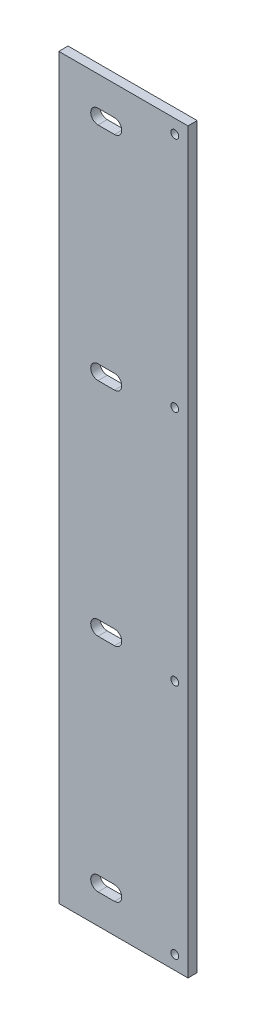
ISO-10303-21;
HEADER;
FILE_DESCRIPTION(('STEP AP214'),'2;1');
FILE_NAME('part.step','',(''),(''),'','','');
FILE_SCHEMA(('AUTOMOTIVE_DESIGN { 1 0 10303 214 1 1 1 1 }'));
ENDSEC;
DATA;
#1=APPLICATION_CONTEXT('core data for automotive mechanical design processes');
#2=APPLICATION_PROTOCOL_DEFINITION('international standard','automotive_design',2000,#1);
#3=PRODUCT_CONTEXT('',#1,'mechanical');
#4=PRODUCT('Part','Part','',(#3));
#5=PRODUCT_RELATED_PRODUCT_CATEGORY('part','',(#4));
#6=PRODUCT_DEFINITION_FORMATION('','',#4);
#7=PRODUCT_DEFINITION_CONTEXT('part definition',#1,'design');
#8=PRODUCT_DEFINITION('design','',#6,#7);
#9=PRODUCT_DEFINITION_SHAPE('','',#8);
#10=(LENGTH_UNIT() NAMED_UNIT(*) SI_UNIT(.MILLI.,.METRE.));
#11=(NAMED_UNIT(*) PLANE_ANGLE_UNIT() SI_UNIT($,.RADIAN.));
#12=(NAMED_UNIT(*) SI_UNIT($,.STERADIAN.) SOLID_ANGLE_UNIT());
#13=UNCERTAINTY_MEASURE_WITH_UNIT(LENGTH_MEASURE(1.E-05),#10,'distance_accuracy_value','');
#14=(GEOMETRIC_REPRESENTATION_CONTEXT(3) GLOBAL_UNCERTAINTY_ASSIGNED_CONTEXT((#13)) GLOBAL_UNIT_ASSIGNED_CONTEXT((#10,
#11,#12)) REPRESENTATION_CONTEXT('',''));
#15=CARTESIAN_POINT('',(0.,0.,0.));
#16=DIRECTION('',(0.,0.,1.));
#17=DIRECTION('',(1.,0.,0.));
#18=AXIS2_PLACEMENT_3D('',#15,#16,#17);
#19=CARTESIAN_POINT('',(-14.9893045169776,183.525395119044,3.175));
#20=DIRECTION('',(1.,0.,0.));
#21=DIRECTION('',(0.,1.,0.));
#22=AXIS2_PLACEMENT_3D('',#19,#20,#21);
#23=PLANE('',#22);
#24=DIRECTION('',(0.,-1.,0.));
#25=VECTOR('',#24,1.);
#26=CARTESIAN_POINT('',(-14.9893045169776,183.525395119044,0.));
#27=LINE('',#26,#25);
#28=CARTESIAN_POINT('',(-14.9893045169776,183.525395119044,0.));
#29=VERTEX_POINT('',#28);
#30=CARTESIAN_POINT('',(-14.9893045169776,-70.4746048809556,0.));
#31=VERTEX_POINT('',#30);
#32=EDGE_CURVE('E324',#29,#31,#27,.T.);
#33=ORIENTED_EDGE('',*,*,#32,.T.);
#34=DIRECTION('',(0.,0.,-1.));
#35=VECTOR('',#34,1.);
#36=CARTESIAN_POINT('',(-14.9893045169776,-70.4746048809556,3.175));
#37=LINE('',#36,#35);
#38=CARTESIAN_POINT('',(-14.9893045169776,-70.4746048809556,3.175));
#39=VERTEX_POINT('',#38);
#40=EDGE_CURVE('E12',#39,#31,#37,.T.);
#41=ORIENTED_EDGE('',*,*,#40,.F.);
#42=DIRECTION('',(0.,-1.,0.));
#43=VECTOR('',#42,1.);
#44=CARTESIAN_POINT('',(-14.9893045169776,183.525395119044,3.175));
#45=LINE('',#44,#43);
#46=CARTESIAN_POINT('',(-14.9893045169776,183.525395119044,3.175));
#47=VERTEX_POINT('',#46);
#48=EDGE_CURVE('E325',#47,#39,#45,.T.);
#49=ORIENTED_EDGE('',*,*,#48,.F.);
#50=DIRECTION('',(0.,0.,-1.));
#51=VECTOR('',#50,1.);
#52=CARTESIAN_POINT('',(-14.9893045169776,183.525395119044,3.175));
#53=LINE('',#52,#51);
#54=EDGE_CURVE('E335',#47,#29,#53,.T.);
#55=ORIENTED_EDGE('',*,*,#54,.T.);
#56=EDGE_LOOP('',(#33,#41,#49,#55));
#57=FACE_BOUND('',#56,.T.);
#58=ADVANCED_FACE('F32',(#57),#23,.F.);
#59=CARTESIAN_POINT('',(-14.9893045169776,-70.4746048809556,3.175));
#60=DIRECTION('',(0.,1.,0.));
#61=DIRECTION('',(-1.,0.,0.));
#62=AXIS2_PLACEMENT_3D('',#59,#60,#61);
#63=PLANE('',#62);
#64=DIRECTION('',(1.,0.,0.));
#65=VECTOR('',#64,1.);
#66=CARTESIAN_POINT('',(-14.9893045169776,-70.4746048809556,0.));
#67=LINE('',#66,#65);
#68=CARTESIAN_POINT('',(29.4606954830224,-70.4746048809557,0.));
#69=VERTEX_POINT('',#68);
#70=EDGE_CURVE('E338',#31,#69,#67,.T.);
#71=ORIENTED_EDGE('',*,*,#70,.T.);
#72=DIRECTION('',(0.,0.,-1.));
#73=VECTOR('',#72,1.);
#74=CARTESIAN_POINT('',(29.4606954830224,-70.4746048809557,3.175));
#75=LINE('',#74,#73);
#76=CARTESIAN_POINT('',(29.4606954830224,-70.4746048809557,3.175));
#77=VERTEX_POINT('',#76);
#78=EDGE_CURVE('E39',#77,#69,#75,.T.);
#79=ORIENTED_EDGE('',*,*,#78,.F.);
#80=DIRECTION('',(1.,0.,0.));
#81=VECTOR('',#80,1.);
#82=CARTESIAN_POINT('',(-14.9893045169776,-70.4746048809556,3.175));
#83=LINE('',#82,#81);
#84=EDGE_CURVE('E328',#39,#77,#83,.T.);
#85=ORIENTED_EDGE('',*,*,#84,.F.);
#86=ORIENTED_EDGE('',*,*,#40,.T.);
#87=EDGE_LOOP('',(#71,#79,#85,#86));
#88=FACE_BOUND('',#87,.T.);
#89=ADVANCED_FACE('F367',(#88),#63,.F.);
#90=CARTESIAN_POINT('',(29.4606954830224,183.525395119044,3.175));
#91=DIRECTION('',(-1.,0.,0.));
#92=DIRECTION('',(0.,-1.,0.));
#93=AXIS2_PLACEMENT_3D('',#90,#91,#92);
#94=PLANE('',#93);
#95=DIRECTION('',(0.,1.,0.));
#96=VECTOR('',#95,1.);
#97=CARTESIAN_POINT('',(29.4606954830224,183.525395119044,0.));
#98=LINE('',#97,#96);
#99=CARTESIAN_POINT('',(29.4606954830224,183.525395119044,0.));
#100=VERTEX_POINT('',#99);
#101=EDGE_CURVE('E340',#69,#100,#98,.T.);
#102=ORIENTED_EDGE('',*,*,#101,.T.);
#103=DIRECTION('',(0.,0.,-1.));
#104=VECTOR('',#103,1.);
#105=CARTESIAN_POINT('',(29.4606954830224,183.525395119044,3.175));
#106=LINE('',#105,#104);
#107=CARTESIAN_POINT('',(29.4606954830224,183.525395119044,3.175));
#108=VERTEX_POINT('',#107);
#109=EDGE_CURVE('E345',#108,#100,#106,.T.);
#110=ORIENTED_EDGE('',*,*,#109,.F.);
#111=DIRECTION('',(0.,1.,0.));
#112=VECTOR('',#111,1.);
#113=CARTESIAN_POINT('',(29.4606954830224,183.525395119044,3.175));
#114=LINE('',#113,#112);
#115=EDGE_CURVE('E331',#77,#108,#114,.T.);
#116=ORIENTED_EDGE('',*,*,#115,.F.);
#117=ORIENTED_EDGE('',*,*,#78,.T.);
#118=EDGE_LOOP('',(#102,#110,#116,#117));
#119=FACE_BOUND('',#118,.T.);
#120=ADVANCED_FACE('F352',(#119),#94,.F.);
#121=CARTESIAN_POINT('',(-14.9893045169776,183.525395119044,3.175));
#122=DIRECTION('',(0.,-1.,0.));
#123=DIRECTION('',(0.,0.,-1.));
#124=AXIS2_PLACEMENT_3D('',#121,#122,#123);
#125=PLANE('',#124);
#126=DIRECTION('',(-1.,0.,0.));
#127=VECTOR('',#126,1.);
#128=CARTESIAN_POINT('',(-14.9893045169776,183.525395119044,0.));
#129=LINE('',#128,#127);
#130=EDGE_CURVE('E329',#100,#29,#129,.T.);
#131=ORIENTED_EDGE('',*,*,#130,.T.);
#132=ORIENTED_EDGE('',*,*,#54,.F.);
#133=DIRECTION('',(-1.,0.,0.));
#134=VECTOR('',#133,1.);
#135=CARTESIAN_POINT('',(-14.9893045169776,183.525395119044,3.175));
#136=LINE('',#135,#134);
#137=EDGE_CURVE('E333',#108,#47,#136,.T.);
#138=ORIENTED_EDGE('',*,*,#137,.F.);
#139=ORIENTED_EDGE('',*,*,#109,.T.);
#140=EDGE_LOOP('',(#131,#132,#138,#139));
#141=FACE_BOUND('',#140,.T.);
#142=ADVANCED_FACE('F360',(#141),#125,.F.);
#143=CARTESIAN_POINT('',(-14.9893045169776,-70.4746048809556,3.175));
#144=DIRECTION('',(0.,0.,1.));
#145=DIRECTION('',(1.,0.,0.));
#146=AXIS2_PLACEMENT_3D('',#143,#144,#145);
#147=PLANE('',#146);
#148=CARTESIAN_POINT('',(-1.50782939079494,-57.7746048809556,3.175));
#149=DIRECTION('',(0.,0.,1.));
#150=DIRECTION('',(1.,0.,0.));
#151=AXIS2_PLACEMENT_3D('',#148,#149,#150);
#152=CIRCLE('',#151,2.5);
#153=CARTESIAN_POINT('',(-1.50782939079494,-55.2746048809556,3.175));
#154=VERTEX_POINT('',#153);
#155=CARTESIAN_POINT('',(-1.50782939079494,-60.2746048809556,3.175));
#156=VERTEX_POINT('',#155);
#157=EDGE_CURVE('E46',#154,#156,#152,.T.);
#158=ORIENTED_EDGE('',*,*,#157,.F.);
#159=DIRECTION('',(-1.,0.,0.));
#160=VECTOR('',#159,1.);
#161=CARTESIAN_POINT('',(-1.50782939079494,-55.2746048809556,3.175));
#162=LINE('',#161,#160);
#163=CARTESIAN_POINT('',(4.17217060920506,-55.2746048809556,3.175));
#164=VERTEX_POINT('',#163);
#165=EDGE_CURVE('E186',#164,#154,#162,.T.);
#166=ORIENTED_EDGE('',*,*,#165,.F.);
#167=CARTESIAN_POINT('',(4.17217060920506,-57.7746048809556,3.175));
#168=DIRECTION('',(0.,0.,1.));
#169=DIRECTION('',(1.,0.,0.));
#170=AXIS2_PLACEMENT_3D('',#167,#168,#169);
#171=CIRCLE('',#170,2.5);
#172=CARTESIAN_POINT('',(4.17217060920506,-60.2746048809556,3.175));
#173=VERTEX_POINT('',#172);
#174=EDGE_CURVE('E189',#173,#164,#171,.T.);
#175=ORIENTED_EDGE('',*,*,#174,.F.);
#176=DIRECTION('',(1.,0.,0.));
#177=VECTOR('',#176,1.);
#178=CARTESIAN_POINT('',(-1.50782939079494,-60.2746048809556,3.175));
#179=LINE('',#178,#177);
#180=EDGE_CURVE('E195',#156,#173,#179,.T.);
#181=ORIENTED_EDGE('',*,*,#180,.F.);
#182=EDGE_LOOP('',(#158,#166,#175,#181));
#183=FACE_BOUND('',#182,.T.);
#184=CARTESIAN_POINT('',(-1.50782939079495,18.4253951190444,3.175));
#185=DIRECTION('',(0.,0.,1.));
#186=DIRECTION('',(1.,0.,0.));
#187=AXIS2_PLACEMENT_3D('',#184,#185,#186);
#188=CIRCLE('',#187,2.5);
#189=CARTESIAN_POINT('',(-1.50782939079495,20.9253951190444,3.175));
#190=VERTEX_POINT('',#189);
#191=CARTESIAN_POINT('',(-1.50782939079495,15.9253951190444,3.175));
#192=VERTEX_POINT('',#191);
#193=EDGE_CURVE('E201',#190,#192,#188,.T.);
#194=ORIENTED_EDGE('',*,*,#193,.F.);
#195=DIRECTION('',(-1.,0.,0.));
#196=VECTOR('',#195,1.);
#197=CARTESIAN_POINT('',(-1.50782939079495,20.9253951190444,3.175));
#198=LINE('',#197,#196);
#199=CARTESIAN_POINT('',(4.17217060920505,20.9253951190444,3.175));
#200=VERTEX_POINT('',#199);
#201=EDGE_CURVE('E209',#200,#190,#198,.T.);
#202=ORIENTED_EDGE('',*,*,#201,.F.);
#203=CARTESIAN_POINT('',(4.17217060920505,18.4253951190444,3.175));
#204=DIRECTION('',(0.,0.,1.));
#205=DIRECTION('',(1.,0.,0.));
#206=AXIS2_PLACEMENT_3D('',#203,#204,#205);
#207=CIRCLE('',#206,2.5);
#208=CARTESIAN_POINT('',(4.17217060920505,15.9253951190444,3.175));
#209=VERTEX_POINT('',#208);
#210=EDGE_CURVE('E223',#209,#200,#207,.T.);
#211=ORIENTED_EDGE('',*,*,#210,.F.);
#212=DIRECTION('',(1.,0.,0.));
#213=VECTOR('',#212,1.);
#214=CARTESIAN_POINT('',(-1.50782939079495,15.9253951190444,3.175));
#215=LINE('',#214,#213);
#216=EDGE_CURVE('E220',#192,#209,#215,.T.);
#217=ORIENTED_EDGE('',*,*,#216,.F.);
#218=EDGE_LOOP('',(#194,#202,#211,#217));
#219=FACE_BOUND('',#218,.T.);
#220=CARTESIAN_POINT('',(-1.50782939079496,94.6253951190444,3.175));
#221=DIRECTION('',(0.,0.,1.));
#222=DIRECTION('',(1.,0.,0.));
#223=AXIS2_PLACEMENT_3D('',#220,#221,#222);
#224=CIRCLE('',#223,2.50000000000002);
#225=CARTESIAN_POINT('',(-1.50782939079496,97.1253951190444,3.175));
#226=VERTEX_POINT('',#225);
#227=CARTESIAN_POINT('',(-1.50782939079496,92.1253951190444,3.175));
#228=VERTEX_POINT('',#227);
#229=EDGE_CURVE('E230',#226,#228,#224,.T.);
#230=ORIENTED_EDGE('',*,*,#229,.F.);
#231=DIRECTION('',(-1.,0.,0.));
#232=VECTOR('',#231,1.);
#233=CARTESIAN_POINT('',(-1.50782939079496,97.1253951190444,3.175));
#234=LINE('',#233,#232);
#235=CARTESIAN_POINT('',(4.17217060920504,97.1253951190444,3.175));
#236=VERTEX_POINT('',#235);
#237=EDGE_CURVE('E241',#236,#226,#234,.T.);
#238=ORIENTED_EDGE('',*,*,#237,.F.);
#239=CARTESIAN_POINT('',(4.17217060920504,94.6253951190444,3.175));
#240=DIRECTION('',(0.,0.,1.));
#241=DIRECTION('',(1.,0.,0.));
#242=AXIS2_PLACEMENT_3D('',#239,#240,#241);
#243=CIRCLE('',#242,2.50000000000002);
#244=CARTESIAN_POINT('',(4.17217060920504,92.1253951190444,3.175));
#245=VERTEX_POINT('',#244);
#246=EDGE_CURVE('E255',#245,#236,#243,.T.);
#247=ORIENTED_EDGE('',*,*,#246,.F.);
#248=DIRECTION('',(1.,0.,0.));
#249=VECTOR('',#248,1.);
#250=CARTESIAN_POINT('',(-1.50782939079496,92.1253951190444,3.175));
#251=LINE('',#250,#249);
#252=EDGE_CURVE('E252',#228,#245,#251,.T.);
#253=ORIENTED_EDGE('',*,*,#252,.F.);
#254=EDGE_LOOP('',(#230,#238,#247,#253));
#255=FACE_BOUND('',#254,.T.);
#256=CARTESIAN_POINT('',(-1.50782939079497,170.825395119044,3.175));
#257=DIRECTION('',(0.,0.,1.));
#258=DIRECTION('',(1.,0.,0.));
#259=AXIS2_PLACEMENT_3D('',#256,#257,#258);
#260=CIRCLE('',#259,2.5);
#261=CARTESIAN_POINT('',(-1.50782939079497,173.325395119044,3.175));
#262=VERTEX_POINT('',#261);
#263=CARTESIAN_POINT('',(-1.50782939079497,168.325395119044,3.175));
#264=VERTEX_POINT('',#263);
#265=EDGE_CURVE('E262',#262,#264,#260,.T.);
#266=ORIENTED_EDGE('',*,*,#265,.F.);
#267=DIRECTION('',(-1.,0.,0.));
#268=VECTOR('',#267,1.);
#269=CARTESIAN_POINT('',(-1.50782939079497,173.325395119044,3.175));
#270=LINE('',#269,#268);
#271=CARTESIAN_POINT('',(4.17217060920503,173.325395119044,3.175));
#272=VERTEX_POINT('',#271);
#273=EDGE_CURVE('E273',#272,#262,#270,.T.);
#274=ORIENTED_EDGE('',*,*,#273,.F.);
#275=CARTESIAN_POINT('',(4.17217060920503,170.825395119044,3.175));
#276=DIRECTION('',(0.,0.,1.));
#277=DIRECTION('',(1.,0.,0.));
#278=AXIS2_PLACEMENT_3D('',#275,#276,#277);
#279=CIRCLE('',#278,2.5);
#280=CARTESIAN_POINT('',(4.17217060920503,168.325395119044,3.175));
#281=VERTEX_POINT('',#280);
#282=EDGE_CURVE('E287',#281,#272,#279,.T.);
#283=ORIENTED_EDGE('',*,*,#282,.F.);
#284=DIRECTION('',(1.,0.,0.));
#285=VECTOR('',#284,1.);
#286=CARTESIAN_POINT('',(-1.50782939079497,168.325395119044,3.175));
#287=LINE('',#286,#285);
#288=EDGE_CURVE('E284',#264,#281,#287,.T.);
#289=ORIENTED_EDGE('',*,*,#288,.F.);
#290=EDGE_LOOP('',(#266,#274,#283,#289));
#291=FACE_BOUND('',#290,.T.);
#292=CARTESIAN_POINT('',(24.9242554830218,178.775595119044,3.175));
#293=DIRECTION('',(0.,0.,1.));
#294=DIRECTION('',(1.,0.,0.));
#295=AXIS2_PLACEMENT_3D('',#292,#293,#294);
#296=CIRCLE('',#295,1.35255);
#297=CARTESIAN_POINT('',(26.2768054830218,178.775595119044,3.175));
#298=VERTEX_POINT('',#297);
#299=EDGE_CURVE('E294',#298,#298,#296,.T.);
#300=ORIENTED_EDGE('',*,*,#299,.F.);
#301=EDGE_LOOP('',(#300));
#302=FACE_BOUND('',#301,.T.);
#303=CARTESIAN_POINT('',(24.9242554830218,97.2923951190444,3.175));
#304=DIRECTION('',(0.,0.,1.));
#305=DIRECTION('',(1.,0.,0.));
#306=AXIS2_PLACEMENT_3D('',#303,#304,#305);
#307=CIRCLE('',#306,1.35255);
#308=CARTESIAN_POINT('',(26.2768054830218,97.2923951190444,3.175));
#309=VERTEX_POINT('',#308);
#310=EDGE_CURVE('E306',#309,#309,#307,.T.);
#311=ORIENTED_EDGE('',*,*,#310,.F.);
#312=EDGE_LOOP('',(#311));
#313=FACE_BOUND('',#312,.T.);
#314=CARTESIAN_POINT('',(24.9242554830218,15.7583951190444,3.175));
#315=DIRECTION('',(0.,0.,1.));
#316=DIRECTION('',(1.,0.,0.));
#317=AXIS2_PLACEMENT_3D('',#314,#315,#316);
#318=CIRCLE('',#317,1.35255);
#319=CARTESIAN_POINT('',(26.2768054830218,15.7583951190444,3.175));
#320=VERTEX_POINT('',#319);
#321=EDGE_CURVE('E312',#320,#320,#318,.T.);
#322=ORIENTED_EDGE('',*,*,#321,.F.);
#323=EDGE_LOOP('',(#322));
#324=FACE_BOUND('',#323,.T.);
#325=CARTESIAN_POINT('',(24.9242554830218,-65.7248048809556,3.175));
#326=DIRECTION('',(0.,0.,1.));
#327=DIRECTION('',(1.,0.,0.));
#328=AXIS2_PLACEMENT_3D('',#325,#326,#327);
#329=CIRCLE('',#328,1.35255);
#330=CARTESIAN_POINT('',(26.2768054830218,-65.7248048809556,3.175));
#331=VERTEX_POINT('',#330);
#332=EDGE_CURVE('E318',#331,#331,#329,.T.);
#333=ORIENTED_EDGE('',*,*,#332,.F.);
#334=EDGE_LOOP('',(#333));
#335=FACE_BOUND('',#334,.T.);
#336=ORIENTED_EDGE('',*,*,#48,.T.);
#337=ORIENTED_EDGE('',*,*,#84,.T.);
#338=ORIENTED_EDGE('',*,*,#115,.T.);
#339=ORIENTED_EDGE('',*,*,#137,.T.);
#340=EDGE_LOOP('',(#336,#337,#338,#339));
#341=FACE_BOUND('',#340,.T.);
#342=ADVANCED_FACE('F366',(#183,#219,#255,#291,#302,#313,#324,#335,#341),#147,.T.);
#343=CARTESIAN_POINT('',(-14.9893045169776,-70.4746048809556,0.));
#344=DIRECTION('',(0.,0.,1.));
#345=DIRECTION('',(1.,0.,0.));
#346=AXIS2_PLACEMENT_3D('',#343,#344,#345);
#347=PLANE('',#346);
#348=DIRECTION('',(-1.,0.,0.));
#349=VECTOR('',#348,1.);
#350=CARTESIAN_POINT('',(-1.50782939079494,-55.2746048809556,0.));
#351=LINE('',#350,#349);
#352=CARTESIAN_POINT('',(4.17217060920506,-55.2746048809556,0.));
#353=VERTEX_POINT('',#352);
#354=CARTESIAN_POINT('',(-1.50782939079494,-55.2746048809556,0.));
#355=VERTEX_POINT('',#354);
#356=EDGE_CURVE('E176',#353,#355,#351,.T.);
#357=ORIENTED_EDGE('',*,*,#356,.T.);
#358=CARTESIAN_POINT('',(-1.50782939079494,-57.7746048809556,0.));
#359=DIRECTION('',(0.,0.,1.));
#360=DIRECTION('',(1.,0.,0.));
#361=AXIS2_PLACEMENT_3D('',#358,#359,#360);
#362=CIRCLE('',#361,2.5);
#363=CARTESIAN_POINT('',(-1.50782939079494,-60.2746048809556,0.));
#364=VERTEX_POINT('',#363);
#365=EDGE_CURVE('E170',#355,#364,#362,.T.);
#366=ORIENTED_EDGE('',*,*,#365,.T.);
#367=DIRECTION('',(1.,0.,0.));
#368=VECTOR('',#367,1.);
#369=CARTESIAN_POINT('',(-1.50782939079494,-60.2746048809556,0.));
#370=LINE('',#369,#368);
#371=CARTESIAN_POINT('',(4.17217060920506,-60.2746048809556,0.));
#372=VERTEX_POINT('',#371);
#373=EDGE_CURVE('E179',#364,#372,#370,.T.);
#374=ORIENTED_EDGE('',*,*,#373,.T.);
#375=CARTESIAN_POINT('',(4.17217060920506,-57.7746048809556,0.));
#376=DIRECTION('',(0.,0.,1.));
#377=DIRECTION('',(1.,0.,0.));
#378=AXIS2_PLACEMENT_3D('',#375,#376,#377);
#379=CIRCLE('',#378,2.5);
#380=EDGE_CURVE('E54',#372,#353,#379,.T.);
#381=ORIENTED_EDGE('',*,*,#380,.T.);
#382=EDGE_LOOP('',(#357,#366,#374,#381));
#383=FACE_BOUND('',#382,.T.);
#384=DIRECTION('',(-1.,0.,0.));
#385=VECTOR('',#384,1.);
#386=CARTESIAN_POINT('',(-1.50782939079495,20.9253951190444,0.));
#387=LINE('',#386,#385);
#388=CARTESIAN_POINT('',(4.17217060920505,20.9253951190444,0.));
#389=VERTEX_POINT('',#388);
#390=CARTESIAN_POINT('',(-1.50782939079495,20.9253951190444,0.));
#391=VERTEX_POINT('',#390);
#392=EDGE_CURVE('E215',#389,#391,#387,.T.);
#393=ORIENTED_EDGE('',*,*,#392,.T.);
#394=CARTESIAN_POINT('',(-1.50782939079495,18.4253951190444,0.));
#395=DIRECTION('',(0.,0.,1.));
#396=DIRECTION('',(1.,0.,0.));
#397=AXIS2_PLACEMENT_3D('',#394,#395,#396);
#398=CIRCLE('',#397,2.5);
#399=CARTESIAN_POINT('',(-1.50782939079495,15.9253951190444,0.));
#400=VERTEX_POINT('',#399);
#401=EDGE_CURVE('E205',#391,#400,#398,.T.);
#402=ORIENTED_EDGE('',*,*,#401,.T.);
#403=DIRECTION('',(1.,0.,0.));
#404=VECTOR('',#403,1.);
#405=CARTESIAN_POINT('',(-1.50782939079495,15.9253951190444,0.));
#406=LINE('',#405,#404);
#407=CARTESIAN_POINT('',(4.17217060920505,15.9253951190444,0.));
#408=VERTEX_POINT('',#407);
#409=EDGE_CURVE('E208',#400,#408,#406,.T.);
#410=ORIENTED_EDGE('',*,*,#409,.T.);
#411=CARTESIAN_POINT('',(4.17217060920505,18.4253951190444,0.));
#412=DIRECTION('',(0.,0.,1.));
#413=DIRECTION('',(1.,0.,0.));
#414=AXIS2_PLACEMENT_3D('',#411,#412,#413);
#415=CIRCLE('',#414,2.5);
#416=EDGE_CURVE('E212',#408,#389,#415,.T.);
#417=ORIENTED_EDGE('',*,*,#416,.T.);
#418=EDGE_LOOP('',(#393,#402,#410,#417));
#419=FACE_BOUND('',#418,.T.);
#420=DIRECTION('',(-1.,0.,0.));
#421=VECTOR('',#420,1.);
#422=CARTESIAN_POINT('',(-1.50782939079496,97.1253951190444,0.));
#423=LINE('',#422,#421);
#424=CARTESIAN_POINT('',(4.17217060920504,97.1253951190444,0.));
#425=VERTEX_POINT('',#424);
#426=CARTESIAN_POINT('',(-1.50782939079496,97.1253951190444,0.));
#427=VERTEX_POINT('',#426);
#428=EDGE_CURVE('E247',#425,#427,#423,.T.);
#429=ORIENTED_EDGE('',*,*,#428,.T.);
#430=CARTESIAN_POINT('',(-1.50782939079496,94.6253951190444,0.));
#431=DIRECTION('',(0.,0.,1.));
#432=DIRECTION('',(1.,0.,0.));
#433=AXIS2_PLACEMENT_3D('',#430,#431,#432);
#434=CIRCLE('',#433,2.50000000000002);
#435=CARTESIAN_POINT('',(-1.50782939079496,92.1253951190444,0.));
#436=VERTEX_POINT('',#435);
#437=EDGE_CURVE('E237',#427,#436,#434,.T.);
#438=ORIENTED_EDGE('',*,*,#437,.T.);
#439=DIRECTION('',(1.,0.,0.));
#440=VECTOR('',#439,1.);
#441=CARTESIAN_POINT('',(-1.50782939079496,92.1253951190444,0.));
#442=LINE('',#441,#440);
#443=CARTESIAN_POINT('',(4.17217060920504,92.1253951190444,0.));
#444=VERTEX_POINT('',#443);
#445=EDGE_CURVE('E240',#436,#444,#442,.T.);
#446=ORIENTED_EDGE('',*,*,#445,.T.);
#447=CARTESIAN_POINT('',(4.17217060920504,94.6253951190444,0.));
#448=DIRECTION('',(0.,0.,1.));
#449=DIRECTION('',(1.,0.,0.));
#450=AXIS2_PLACEMENT_3D('',#447,#448,#449);
#451=CIRCLE('',#450,2.50000000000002);
#452=EDGE_CURVE('E244',#444,#425,#451,.T.);
#453=ORIENTED_EDGE('',*,*,#452,.T.);
#454=EDGE_LOOP('',(#429,#438,#446,#453));
#455=FACE_BOUND('',#454,.T.);
#456=DIRECTION('',(-1.,0.,0.));
#457=VECTOR('',#456,1.);
#458=CARTESIAN_POINT('',(-1.50782939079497,173.325395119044,0.));
#459=LINE('',#458,#457);
#460=CARTESIAN_POINT('',(4.17217060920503,173.325395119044,0.));
#461=VERTEX_POINT('',#460);
#462=CARTESIAN_POINT('',(-1.50782939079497,173.325395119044,0.));
#463=VERTEX_POINT('',#462);
#464=EDGE_CURVE('E279',#461,#463,#459,.T.);
#465=ORIENTED_EDGE('',*,*,#464,.T.);
#466=CARTESIAN_POINT('',(-1.50782939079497,170.825395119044,0.));
#467=DIRECTION('',(0.,0.,1.));
#468=DIRECTION('',(1.,0.,0.));
#469=AXIS2_PLACEMENT_3D('',#466,#467,#468);
#470=CIRCLE('',#469,2.5);
#471=CARTESIAN_POINT('',(-1.50782939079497,168.325395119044,0.));
#472=VERTEX_POINT('',#471);
#473=EDGE_CURVE('E269',#463,#472,#470,.T.);
#474=ORIENTED_EDGE('',*,*,#473,.T.);
#475=DIRECTION('',(1.,0.,0.));
#476=VECTOR('',#475,1.);
#477=CARTESIAN_POINT('',(-1.50782939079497,168.325395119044,0.));
#478=LINE('',#477,#476);
#479=CARTESIAN_POINT('',(4.17217060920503,168.325395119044,0.));
#480=VERTEX_POINT('',#479);
#481=EDGE_CURVE('E272',#472,#480,#478,.T.);
#482=ORIENTED_EDGE('',*,*,#481,.T.);
#483=CARTESIAN_POINT('',(4.17217060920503,170.825395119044,0.));
#484=DIRECTION('',(0.,0.,1.));
#485=DIRECTION('',(1.,0.,0.));
#486=AXIS2_PLACEMENT_3D('',#483,#484,#485);
#487=CIRCLE('',#486,2.5);
#488=EDGE_CURVE('E276',#480,#461,#487,.T.);
#489=ORIENTED_EDGE('',*,*,#488,.T.);
#490=EDGE_LOOP('',(#465,#474,#482,#489));
#491=FACE_BOUND('',#490,.T.);
#492=CARTESIAN_POINT('',(24.9242554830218,178.775595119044,0.));
#493=DIRECTION('',(0.,0.,1.));
#494=DIRECTION('',(1.,0.,0.));
#495=AXIS2_PLACEMENT_3D('',#492,#493,#494);
#496=CIRCLE('',#495,1.35255);
#497=CARTESIAN_POINT('',(26.2768054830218,178.775595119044,0.));
#498=VERTEX_POINT('',#497);
#499=EDGE_CURVE('E303',#498,#498,#496,.T.);
#500=ORIENTED_EDGE('',*,*,#499,.T.);
#501=EDGE_LOOP('',(#500));
#502=FACE_BOUND('',#501,.T.);
#503=CARTESIAN_POINT('',(24.9242554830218,97.2923951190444,0.));
#504=DIRECTION('',(0.,0.,1.));
#505=DIRECTION('',(1.,0.,0.));
#506=AXIS2_PLACEMENT_3D('',#503,#504,#505);
#507=CIRCLE('',#506,1.35255);
#508=CARTESIAN_POINT('',(26.2768054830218,97.2923951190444,0.));
#509=VERTEX_POINT('',#508);
#510=EDGE_CURVE('E309',#509,#509,#507,.T.);
#511=ORIENTED_EDGE('',*,*,#510,.T.);
#512=EDGE_LOOP('',(#511));
#513=FACE_BOUND('',#512,.T.);
#514=CARTESIAN_POINT('',(24.9242554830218,15.7583951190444,0.));
#515=DIRECTION('',(0.,0.,1.));
#516=DIRECTION('',(1.,0.,0.));
#517=AXIS2_PLACEMENT_3D('',#514,#515,#516);
#518=CIRCLE('',#517,1.35255);
#519=CARTESIAN_POINT('',(26.2768054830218,15.7583951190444,0.));
#520=VERTEX_POINT('',#519);
#521=EDGE_CURVE('E315',#520,#520,#518,.T.);
#522=ORIENTED_EDGE('',*,*,#521,.T.);
#523=EDGE_LOOP('',(#522));
#524=FACE_BOUND('',#523,.T.);
#525=CARTESIAN_POINT('',(24.9242554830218,-65.7248048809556,0.));
#526=DIRECTION('',(0.,0.,1.));
#527=DIRECTION('',(1.,0.,0.));
#528=AXIS2_PLACEMENT_3D('',#525,#526,#527);
#529=CIRCLE('',#528,1.35255);
#530=CARTESIAN_POINT('',(26.2768054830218,-65.7248048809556,0.));
#531=VERTEX_POINT('',#530);
#532=EDGE_CURVE('E321',#531,#531,#529,.T.);
#533=ORIENTED_EDGE('',*,*,#532,.T.);
#534=EDGE_LOOP('',(#533));
#535=FACE_BOUND('',#534,.T.);
#536=ORIENTED_EDGE('',*,*,#32,.F.);
#537=ORIENTED_EDGE('',*,*,#130,.F.);
#538=ORIENTED_EDGE('',*,*,#101,.F.);
#539=ORIENTED_EDGE('',*,*,#70,.F.);
#540=EDGE_LOOP('',(#536,#537,#538,#539));
#541=FACE_BOUND('',#540,.T.);
#542=ADVANCED_FACE('F183',(#383,#419,#455,#491,#502,#513,#524,#535,#541),#347,.F.);
#543=CARTESIAN_POINT('',(24.9242554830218,-65.7248048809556,3.175));
#544=DIRECTION('',(0.,0.,1.));
#545=DIRECTION('',(1.,0.,0.));
#546=AXIS2_PLACEMENT_3D('',#543,#544,#545);
#547=CYLINDRICAL_SURFACE('',#546,1.35255);
#548=ORIENTED_EDGE('',*,*,#532,.F.);
#549=EDGE_LOOP('',(#548));
#550=FACE_BOUND('',#549,.T.);
#551=ORIENTED_EDGE('',*,*,#332,.T.);
#552=EDGE_LOOP('',(#551));
#553=FACE_BOUND('',#552,.T.);
#554=ADVANCED_FACE('F379',(#550,#553),#547,.F.);
#555=CARTESIAN_POINT('',(24.9242554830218,15.7583951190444,3.175));
#556=DIRECTION('',(0.,0.,1.));
#557=DIRECTION('',(1.,0.,0.));
#558=AXIS2_PLACEMENT_3D('',#555,#556,#557);
#559=CYLINDRICAL_SURFACE('',#558,1.35255);
#560=ORIENTED_EDGE('',*,*,#521,.F.);
#561=EDGE_LOOP('',(#560));
#562=FACE_BOUND('',#561,.T.);
#563=ORIENTED_EDGE('',*,*,#321,.T.);
#564=EDGE_LOOP('',(#563));
#565=FACE_BOUND('',#564,.T.);
#566=ADVANCED_FACE('F385',(#562,#565),#559,.F.);
#567=CARTESIAN_POINT('',(24.9242554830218,97.2923951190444,3.175));
#568=DIRECTION('',(0.,0.,1.));
#569=DIRECTION('',(1.,0.,0.));
#570=AXIS2_PLACEMENT_3D('',#567,#568,#569);
#571=CYLINDRICAL_SURFACE('',#570,1.35255);
#572=ORIENTED_EDGE('',*,*,#510,.F.);
#573=EDGE_LOOP('',(#572));
#574=FACE_BOUND('',#573,.T.);
#575=ORIENTED_EDGE('',*,*,#310,.T.);
#576=EDGE_LOOP('',(#575));
#577=FACE_BOUND('',#576,.T.);
#578=ADVANCED_FACE('F389',(#574,#577),#571,.F.);
#579=CARTESIAN_POINT('',(24.9242554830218,178.775595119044,3.175));
#580=DIRECTION('',(0.,0.,1.));
#581=DIRECTION('',(1.,0.,0.));
#582=AXIS2_PLACEMENT_3D('',#579,#580,#581);
#583=CYLINDRICAL_SURFACE('',#582,1.35255);
#584=ORIENTED_EDGE('',*,*,#499,.F.);
#585=EDGE_LOOP('',(#584));
#586=FACE_BOUND('',#585,.T.);
#587=ORIENTED_EDGE('',*,*,#299,.T.);
#588=EDGE_LOOP('',(#587));
#589=FACE_BOUND('',#588,.T.);
#590=ADVANCED_FACE('F393',(#586,#589),#583,.F.);
#591=CARTESIAN_POINT('',(-1.50782939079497,170.825395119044,0.));
#592=DIRECTION('',(0.,0.,1.));
#593=DIRECTION('',(1.,0.,0.));
#594=AXIS2_PLACEMENT_3D('',#591,#592,#593);
#595=CYLINDRICAL_SURFACE('',#594,2.5);
#596=ORIENTED_EDGE('',*,*,#265,.T.);
#597=DIRECTION('',(0.,0.,1.));
#598=VECTOR('',#597,1.);
#599=CARTESIAN_POINT('',(-1.50782939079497,168.325395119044,0.));
#600=LINE('',#599,#598);
#601=EDGE_CURVE('E282',#472,#264,#600,.T.);
#602=ORIENTED_EDGE('',*,*,#601,.F.);
#603=ORIENTED_EDGE('',*,*,#473,.F.);
#604=DIRECTION('',(0.,0.,1.));
#605=VECTOR('',#604,1.);
#606=CARTESIAN_POINT('',(-1.50782939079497,173.325395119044,0.));
#607=LINE('',#606,#605);
#608=EDGE_CURVE('E292',#463,#262,#607,.T.);
#609=ORIENTED_EDGE('',*,*,#608,.T.);
#610=EDGE_LOOP('',(#596,#602,#603,#609));
#611=FACE_BOUND('',#610,.T.);
#612=ADVANCED_FACE('F397',(#611),#595,.F.);
#613=CARTESIAN_POINT('',(-1.50782939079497,173.325395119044,0.));
#614=DIRECTION('',(0.,1.,0.));
#615=DIRECTION('',(0.,0.,1.));
#616=AXIS2_PLACEMENT_3D('',#613,#614,#615);
#617=PLANE('',#616);
#618=ORIENTED_EDGE('',*,*,#273,.T.);
#619=ORIENTED_EDGE('',*,*,#608,.F.);
#620=ORIENTED_EDGE('',*,*,#464,.F.);
#621=DIRECTION('',(0.,0.,1.));
#622=VECTOR('',#621,1.);
#623=CARTESIAN_POINT('',(4.17217060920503,173.325395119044,0.));
#624=LINE('',#623,#622);
#625=EDGE_CURVE('E295',#461,#272,#624,.T.);
#626=ORIENTED_EDGE('',*,*,#625,.T.);
#627=EDGE_LOOP('',(#618,#619,#620,#626));
#628=FACE_BOUND('',#627,.T.);
#629=ADVANCED_FACE('F401',(#628),#617,.F.);
#630=CARTESIAN_POINT('',(4.17217060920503,170.825395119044,0.));
#631=DIRECTION('',(0.,0.,1.));
#632=DIRECTION('',(1.,0.,0.));
#633=AXIS2_PLACEMENT_3D('',#630,#631,#632);
#634=CYLINDRICAL_SURFACE('',#633,2.5);
#635=ORIENTED_EDGE('',*,*,#282,.T.);
#636=ORIENTED_EDGE('',*,*,#625,.F.);
#637=ORIENTED_EDGE('',*,*,#488,.F.);
#638=DIRECTION('',(0.,0.,1.));
#639=VECTOR('',#638,1.);
#640=CARTESIAN_POINT('',(4.17217060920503,168.325395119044,0.));
#641=LINE('',#640,#639);
#642=EDGE_CURVE('E297',#480,#281,#641,.T.);
#643=ORIENTED_EDGE('',*,*,#642,.T.);
#644=EDGE_LOOP('',(#635,#636,#637,#643));
#645=FACE_BOUND('',#644,.T.);
#646=ADVANCED_FACE('F407',(#645),#634,.F.);
#647=CARTESIAN_POINT('',(-1.50782939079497,168.325395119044,0.));
#648=DIRECTION('',(0.,-1.,0.));
#649=DIRECTION('',(0.,0.,-1.));
#650=AXIS2_PLACEMENT_3D('',#647,#648,#649);
#651=PLANE('',#650);
#652=ORIENTED_EDGE('',*,*,#288,.T.);
#653=ORIENTED_EDGE('',*,*,#642,.F.);
#654=ORIENTED_EDGE('',*,*,#481,.F.);
#655=ORIENTED_EDGE('',*,*,#601,.T.);
#656=EDGE_LOOP('',(#652,#653,#654,#655));
#657=FACE_BOUND('',#656,.T.);
#658=ADVANCED_FACE('F403',(#657),#651,.F.);
#659=CARTESIAN_POINT('',(-1.50782939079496,94.6253951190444,0.));
#660=DIRECTION('',(0.,0.,1.));
#661=DIRECTION('',(1.,0.,0.));
#662=AXIS2_PLACEMENT_3D('',#659,#660,#661);
#663=CYLINDRICAL_SURFACE('',#662,2.50000000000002);
#664=ORIENTED_EDGE('',*,*,#229,.T.);
#665=DIRECTION('',(0.,0.,1.));
#666=VECTOR('',#665,1.);
#667=CARTESIAN_POINT('',(-1.50782939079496,92.1253951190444,0.));
#668=LINE('',#667,#666);
#669=EDGE_CURVE('E250',#436,#228,#668,.T.);
#670=ORIENTED_EDGE('',*,*,#669,.F.);
#671=ORIENTED_EDGE('',*,*,#437,.F.);
#672=DIRECTION('',(0.,0.,1.));
#673=VECTOR('',#672,1.);
#674=CARTESIAN_POINT('',(-1.50782939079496,97.1253951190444,0.));
#675=LINE('',#674,#673);
#676=EDGE_CURVE('E260',#427,#226,#675,.T.);
#677=ORIENTED_EDGE('',*,*,#676,.T.);
#678=EDGE_LOOP('',(#664,#670,#671,#677));
#679=FACE_BOUND('',#678,.T.);
#680=ADVANCED_FACE('F406',(#679),#663,.F.);
#681=CARTESIAN_POINT('',(-1.50782939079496,97.1253951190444,0.));
#682=DIRECTION('',(0.,1.,0.));
#683=DIRECTION('',(0.,0.,1.));
#684=AXIS2_PLACEMENT_3D('',#681,#682,#683);
#685=PLANE('',#684);
#686=ORIENTED_EDGE('',*,*,#237,.T.);
#687=ORIENTED_EDGE('',*,*,#676,.F.);
#688=ORIENTED_EDGE('',*,*,#428,.F.);
#689=DIRECTION('',(0.,0.,1.));
#690=VECTOR('',#689,1.);
#691=CARTESIAN_POINT('',(4.17217060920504,97.1253951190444,0.));
#692=LINE('',#691,#690);
#693=EDGE_CURVE('E263',#425,#236,#692,.T.);
#694=ORIENTED_EDGE('',*,*,#693,.T.);
#695=EDGE_LOOP('',(#686,#687,#688,#694));
#696=FACE_BOUND('',#695,.T.);
#697=ADVANCED_FACE('F417',(#696),#685,.F.);
#698=CARTESIAN_POINT('',(4.17217060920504,94.6253951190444,0.));
#699=DIRECTION('',(0.,0.,1.));
#700=DIRECTION('',(1.,0.,0.));
#701=AXIS2_PLACEMENT_3D('',#698,#699,#700);
#702=CYLINDRICAL_SURFACE('',#701,2.50000000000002);
#703=ORIENTED_EDGE('',*,*,#246,.T.);
#704=ORIENTED_EDGE('',*,*,#693,.F.);
#705=ORIENTED_EDGE('',*,*,#452,.F.);
#706=DIRECTION('',(0.,0.,1.));
#707=VECTOR('',#706,1.);
#708=CARTESIAN_POINT('',(4.17217060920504,92.1253951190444,0.));
#709=LINE('',#708,#707);
#710=EDGE_CURVE('E265',#444,#245,#709,.T.);
#711=ORIENTED_EDGE('',*,*,#710,.T.);
#712=EDGE_LOOP('',(#703,#704,#705,#711));
#713=FACE_BOUND('',#712,.T.);
#714=ADVANCED_FACE('F423',(#713),#702,.F.);
#715=CARTESIAN_POINT('',(-1.50782939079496,92.1253951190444,0.));
#716=DIRECTION('',(0.,-1.,0.));
#717=DIRECTION('',(0.,0.,-1.));
#718=AXIS2_PLACEMENT_3D('',#715,#716,#717);
#719=PLANE('',#718);
#720=ORIENTED_EDGE('',*,*,#252,.T.);
#721=ORIENTED_EDGE('',*,*,#710,.F.);
#722=ORIENTED_EDGE('',*,*,#445,.F.);
#723=ORIENTED_EDGE('',*,*,#669,.T.);
#724=EDGE_LOOP('',(#720,#721,#722,#723));
#725=FACE_BOUND('',#724,.T.);
#726=ADVANCED_FACE('F419',(#725),#719,.F.);
#727=CARTESIAN_POINT('',(-1.50782939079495,18.4253951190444,0.));
#728=DIRECTION('',(0.,0.,1.));
#729=DIRECTION('',(1.,0.,0.));
#730=AXIS2_PLACEMENT_3D('',#727,#728,#729);
#731=CYLINDRICAL_SURFACE('',#730,2.5);
#732=ORIENTED_EDGE('',*,*,#193,.T.);
#733=DIRECTION('',(0.,0.,1.));
#734=VECTOR('',#733,1.);
#735=CARTESIAN_POINT('',(-1.50782939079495,15.9253951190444,0.));
#736=LINE('',#735,#734);
#737=EDGE_CURVE('E218',#400,#192,#736,.T.);
#738=ORIENTED_EDGE('',*,*,#737,.F.);
#739=ORIENTED_EDGE('',*,*,#401,.F.);
#740=DIRECTION('',(0.,0.,1.));
#741=VECTOR('',#740,1.);
#742=CARTESIAN_POINT('',(-1.50782939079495,20.9253951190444,0.));
#743=LINE('',#742,#741);
#744=EDGE_CURVE('E228',#391,#190,#743,.T.);
#745=ORIENTED_EDGE('',*,*,#744,.T.);
#746=EDGE_LOOP('',(#732,#738,#739,#745));
#747=FACE_BOUND('',#746,.T.);
#748=ADVANCED_FACE('F422',(#747),#731,.F.);
#749=CARTESIAN_POINT('',(-1.50782939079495,20.9253951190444,0.));
#750=DIRECTION('',(0.,1.,0.));
#751=DIRECTION('',(0.,0.,1.));
#752=AXIS2_PLACEMENT_3D('',#749,#750,#751);
#753=PLANE('',#752);
#754=ORIENTED_EDGE('',*,*,#201,.T.);
#755=ORIENTED_EDGE('',*,*,#744,.F.);
#756=ORIENTED_EDGE('',*,*,#392,.F.);
#757=DIRECTION('',(0.,0.,1.));
#758=VECTOR('',#757,1.);
#759=CARTESIAN_POINT('',(4.17217060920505,20.9253951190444,0.));
#760=LINE('',#759,#758);
#761=EDGE_CURVE('E231',#389,#200,#760,.T.);
#762=ORIENTED_EDGE('',*,*,#761,.T.);
#763=EDGE_LOOP('',(#754,#755,#756,#762));
#764=FACE_BOUND('',#763,.T.);
#765=ADVANCED_FACE('F433',(#764),#753,.F.);
#766=CARTESIAN_POINT('',(4.17217060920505,18.4253951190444,0.));
#767=DIRECTION('',(0.,0.,1.));
#768=DIRECTION('',(1.,0.,0.));
#769=AXIS2_PLACEMENT_3D('',#766,#767,#768);
#770=CYLINDRICAL_SURFACE('',#769,2.5);
#771=ORIENTED_EDGE('',*,*,#210,.T.);
#772=ORIENTED_EDGE('',*,*,#761,.F.);
#773=ORIENTED_EDGE('',*,*,#416,.F.);
#774=DIRECTION('',(0.,0.,1.));
#775=VECTOR('',#774,1.);
#776=CARTESIAN_POINT('',(4.17217060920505,15.9253951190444,0.));
#777=LINE('',#776,#775);
#778=EDGE_CURVE('E233',#408,#209,#777,.T.);
#779=ORIENTED_EDGE('',*,*,#778,.T.);
#780=EDGE_LOOP('',(#771,#772,#773,#779));
#781=FACE_BOUND('',#780,.T.);
#782=ADVANCED_FACE('F438',(#781),#770,.F.);
#783=CARTESIAN_POINT('',(-1.50782939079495,15.9253951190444,0.));
#784=DIRECTION('',(0.,-1.,0.));
#785=DIRECTION('',(0.,0.,-1.));
#786=AXIS2_PLACEMENT_3D('',#783,#784,#785);
#787=PLANE('',#786);
#788=ORIENTED_EDGE('',*,*,#216,.T.);
#789=ORIENTED_EDGE('',*,*,#778,.F.);
#790=ORIENTED_EDGE('',*,*,#409,.F.);
#791=ORIENTED_EDGE('',*,*,#737,.T.);
#792=EDGE_LOOP('',(#788,#789,#790,#791));
#793=FACE_BOUND('',#792,.T.);
#794=ADVANCED_FACE('F435',(#793),#787,.F.);
#795=CARTESIAN_POINT('',(-1.50782939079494,-57.7746048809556,0.));
#796=DIRECTION('',(0.,0.,1.));
#797=DIRECTION('',(1.,0.,0.));
#798=AXIS2_PLACEMENT_3D('',#795,#796,#797);
#799=CYLINDRICAL_SURFACE('',#798,2.5);
#800=ORIENTED_EDGE('',*,*,#157,.T.);
#801=DIRECTION('',(0.,0.,1.));
#802=VECTOR('',#801,1.);
#803=CARTESIAN_POINT('',(-1.50782939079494,-60.2746048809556,0.));
#804=LINE('',#803,#802);
#805=EDGE_CURVE('E166',#364,#156,#804,.T.);
#806=ORIENTED_EDGE('',*,*,#805,.F.);
#807=ORIENTED_EDGE('',*,*,#365,.F.);
#808=DIRECTION('',(0.,0.,1.));
#809=VECTOR('',#808,1.);
#810=CARTESIAN_POINT('',(-1.50782939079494,-55.2746048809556,0.));
#811=LINE('',#810,#809);
#812=EDGE_CURVE('E199',#355,#154,#811,.T.);
#813=ORIENTED_EDGE('',*,*,#812,.T.);
#814=EDGE_LOOP('',(#800,#806,#807,#813));
#815=FACE_BOUND('',#814,.T.);
#816=ADVANCED_FACE('F168',(#815),#799,.F.);
#817=CARTESIAN_POINT('',(-1.50782939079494,-55.2746048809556,0.));
#818=DIRECTION('',(0.,1.,0.));
#819=DIRECTION('',(0.,0.,1.));
#820=AXIS2_PLACEMENT_3D('',#817,#818,#819);
#821=PLANE('',#820);
#822=ORIENTED_EDGE('',*,*,#165,.T.);
#823=ORIENTED_EDGE('',*,*,#812,.F.);
#824=ORIENTED_EDGE('',*,*,#356,.F.);
#825=DIRECTION('',(0.,0.,1.));
#826=VECTOR('',#825,1.);
#827=CARTESIAN_POINT('',(4.17217060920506,-55.2746048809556,0.));
#828=LINE('',#827,#826);
#829=EDGE_CURVE('E202',#353,#164,#828,.T.);
#830=ORIENTED_EDGE('',*,*,#829,.T.);
#831=EDGE_LOOP('',(#822,#823,#824,#830));
#832=FACE_BOUND('',#831,.T.);
#833=ADVANCED_FACE('F448',(#832),#821,.F.);
#834=CARTESIAN_POINT('',(4.17217060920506,-57.7746048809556,0.));
#835=DIRECTION('',(0.,0.,1.));
#836=DIRECTION('',(1.,0.,0.));
#837=AXIS2_PLACEMENT_3D('',#834,#835,#836);
#838=CYLINDRICAL_SURFACE('',#837,2.5);
#839=ORIENTED_EDGE('',*,*,#174,.T.);
#840=ORIENTED_EDGE('',*,*,#829,.F.);
#841=ORIENTED_EDGE('',*,*,#380,.F.);
#842=DIRECTION('',(0.,0.,1.));
#843=VECTOR('',#842,1.);
#844=CARTESIAN_POINT('',(4.17217060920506,-60.2746048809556,0.));
#845=LINE('',#844,#843);
#846=EDGE_CURVE('E175',#372,#173,#845,.T.);
#847=ORIENTED_EDGE('',*,*,#846,.T.);
#848=EDGE_LOOP('',(#839,#840,#841,#847));
#849=FACE_BOUND('',#848,.T.);
#850=ADVANCED_FACE('F451',(#849),#838,.F.);
#851=CARTESIAN_POINT('',(-1.50782939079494,-60.2746048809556,0.));
#852=DIRECTION('',(0.,-1.,0.));
#853=DIRECTION('',(0.,0.,-1.));
#854=AXIS2_PLACEMENT_3D('',#851,#852,#853);
#855=PLANE('',#854);
#856=ORIENTED_EDGE('',*,*,#180,.T.);
#857=ORIENTED_EDGE('',*,*,#846,.F.);
#858=ORIENTED_EDGE('',*,*,#373,.F.);
#859=ORIENTED_EDGE('',*,*,#805,.T.);
#860=EDGE_LOOP('',(#856,#857,#858,#859));
#861=FACE_BOUND('',#860,.T.);
#862=ADVANCED_FACE('F180',(#861),#855,.F.);
#863=CLOSED_SHELL('',(#58,#89,#120,#142,#342,#542,#554,#566,#578,#590,#612,#629,#646,#658,#680,
#697,#714,#726,#748,#765,#782,#794,#816,#833,#850,#862));
#864=MANIFOLD_SOLID_BREP('B2',#863);
#865=ADVANCED_BREP_SHAPE_REPRESENTATION('',(#18,#864),#14);
#866=SHAPE_DEFINITION_REPRESENTATION(#9,#865);
ENDSEC;
END-ISO-10303-21;
